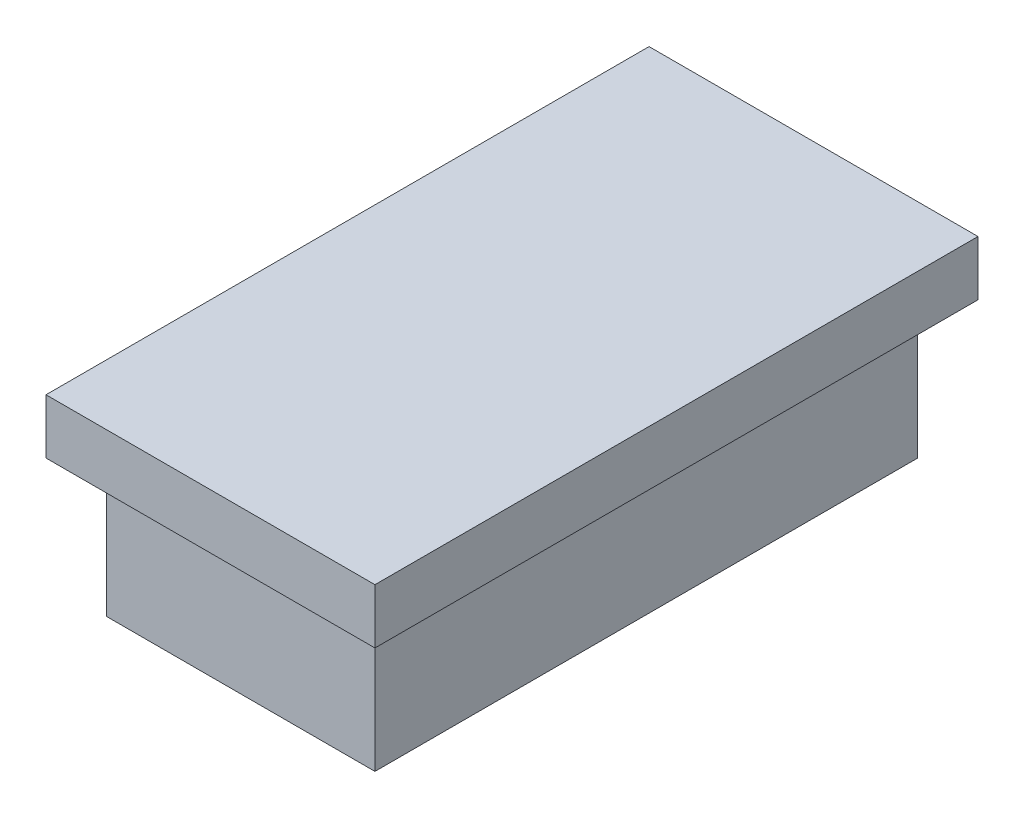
from build123d import *

# Parameters (mm, degrees)
SKETCH1_W           = 9.8
SKETCH1_H           = 19.8
BOSS_EXTRUDE1_DEPTH = 5
SKETCH2_W           = 12
SKETCH2_H           = 22
BOSS_EXTRUDE2_DEPTH = 2


with BuildPart() as part:
    # Sketch1 → Boss-Extrude1 (new body)
    with BuildSketch(Plane(origin=(0, 0, 0), x_dir=(1, 0, 0), z_dir=(0, 1, 0))):
        Rectangle(SKETCH1_W, SKETCH1_H)
    extrude(amount=BOSS_EXTRUDE1_DEPTH)

    # Sketch2 → Boss-Extrude2 (add)
    with BuildSketch(Plane(origin=(0, 5, 0), x_dir=(1, 0, 0), z_dir=(0, 1, 0))):
        Rectangle(SKETCH2_W, SKETCH2_H)
    extrude(amount=BOSS_EXTRUDE2_DEPTH)


solid = part.part
